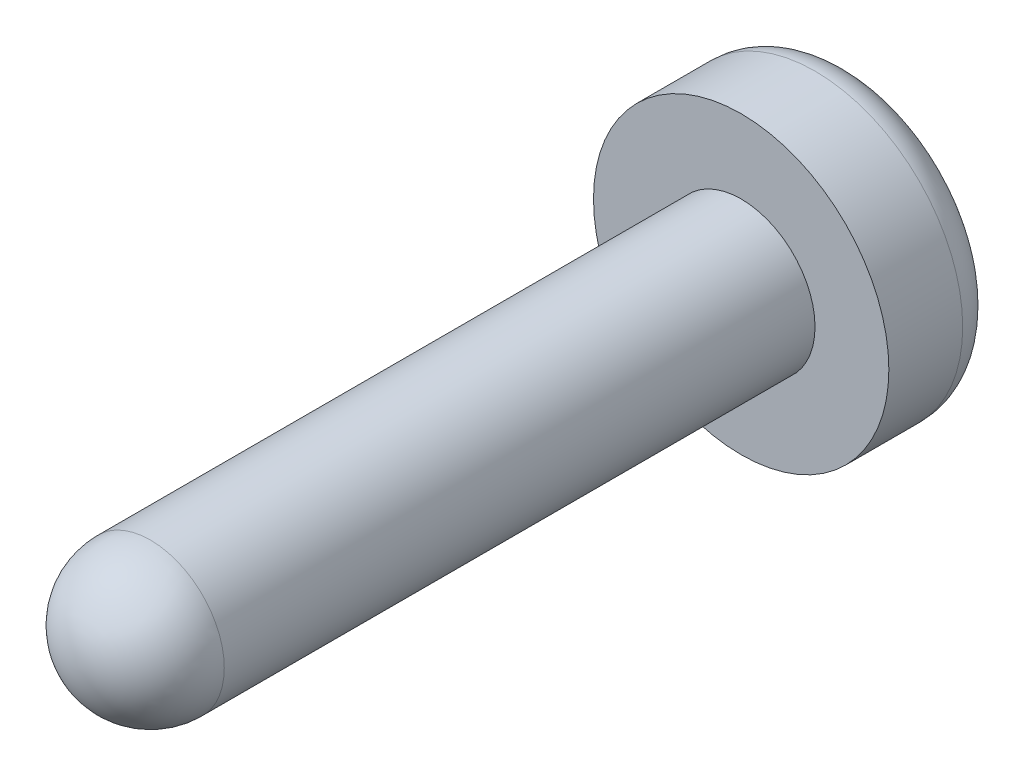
from build123d import *

# Parameters (mm, degrees)
SKIZZE1_R                       = 2
AUFSATZ_LINEAR_AUSTRAGEN1_DEPTH = 1.5
SKIZZE2_R                       = 1
AUFSATZ_LINEAR_AUSTRAGEN2_DEPTH = 9
VERRUNDUNG1_R                   = 1
VERRUNDUNG2_R                   = 0.5
SKIZZE3_W                       = 0.829527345
SKIZZE3_H                       = 0.629507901
SKIZZE3_W_2                     = 0.632202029
SKIZZE3_H_2                     = 0.871689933
SKIZZE3_W_3                     = 0.872489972
SKIZZE3_H_3                     = 0.858509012
SCHNITT_LINEAR_AUSTRAGEN1_DEPTH = 0.5


with BuildPart() as part:
    # Skizze1 → Aufsatz-Linear austragen1 (new body)
    with BuildSketch(Plane.XY):
        Circle(SKIZZE1_R)
    extrude(amount=AUFSATZ_LINEAR_AUSTRAGEN1_DEPTH)

    # Skizze2 → Aufsatz-Linear austragen2 (add)
    with BuildSketch(Plane.XY.offset(1.5)):
        Circle(SKIZZE2_R)
    extrude(amount=AUFSATZ_LINEAR_AUSTRAGEN2_DEPTH)

    # Verrundung1
    verrundung1_edges = [part.edges().sort_by_distance(p)[0] for p in [
        (-1, 0, 10.5),
    ]]
    fillet(verrundung1_edges, radius=VERRUNDUNG1_R)

    # Verrundung2
    verrundung2_edges = [part.edges().sort_by_distance(p)[0] for p in [
        (-2, 0, 0),
    ]]
    fillet(verrundung2_edges, radius=VERRUNDUNG2_R)

    # Skizze3 → Schnitt-Linear austragen1 (cut)
    with BuildSketch(Plane(origin=(0, 0, 0), x_dir=(-1, 0, 0), z_dir=(0, 0, -1))):
        with Locations((-0.731284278, -0.043253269)):
            Rectangle(SKIZZE3_W, SKIZZE3_H)
        with Locations((-0.00041959, 0.707345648)):
            Rectangle(SKIZZE3_W_2, SKIZZE3_H_2)
        with Locations((0.75192641, -0.043253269)):
            Rectangle(SKIZZE3_W_3, SKIZZE3_H)
        with Locations((-0.00041959, -0.787261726)):
            Rectangle(SKIZZE3_W_2, SKIZZE3_H_3)
        with Locations((-0.00041959, -0.043253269)):
            Rectangle(SKIZZE3_W_2, SKIZZE3_H)
    extrude(amount=-SCHNITT_LINEAR_AUSTRAGEN1_DEPTH, mode=Mode.SUBTRACT)


solid = part.part
